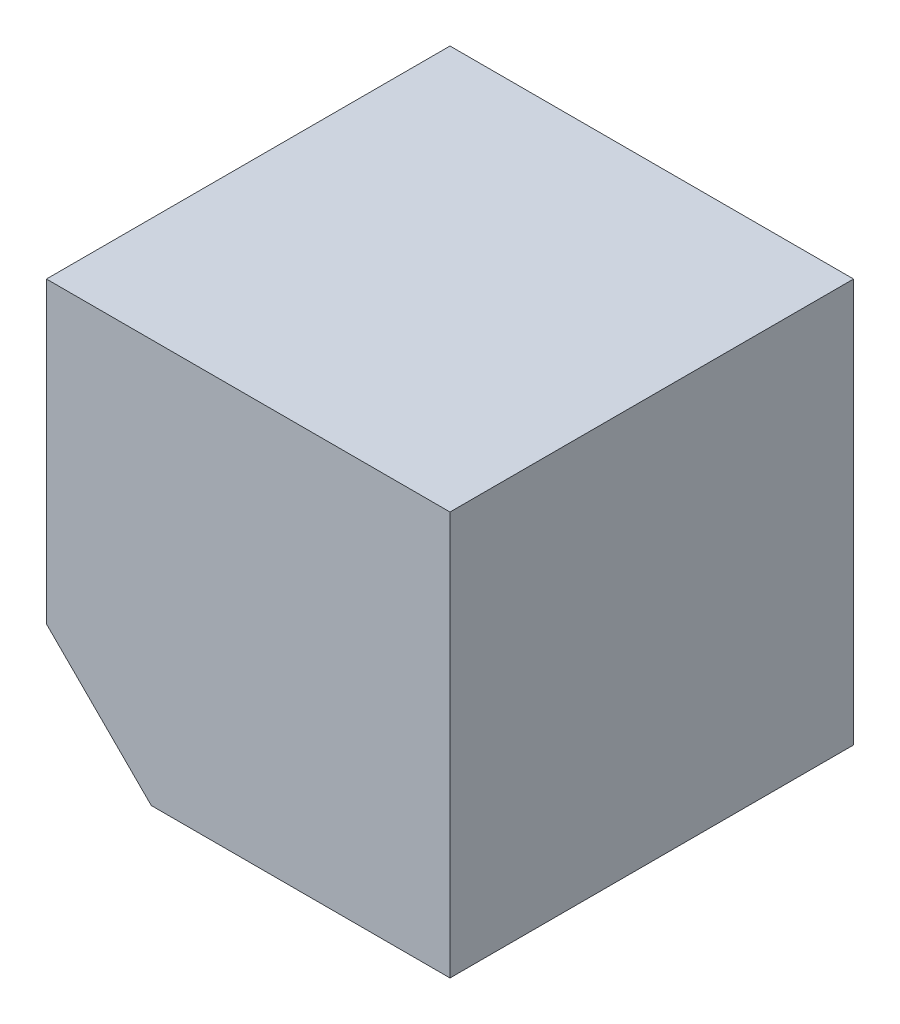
from build123d import *

# Parameters (mm, degrees)
SKIZZE1_W               = 100
SKIZZE1_H               = 100
LINEAR_AUSTRAGEN1_DEPTH = 100


with BuildPart() as part:
    # Skizze1 → Linear austragen1 (new body)
    with BuildSketch(Plane.XY):
        with Locations((50, 50)):
            Rectangle(SKIZZE1_W, SKIZZE1_H)
    extrude(amount=LINEAR_AUSTRAGEN1_DEPTH)

    # Oberfl_chenschnitt1
    split(bisect_by=Plane(origin=(-24.673079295, -24.673079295, 24.673079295), x_dir=(-0.816496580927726, 0.408248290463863, -0.4082482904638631), z_dir=(0.5773502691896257, 0.5773502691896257, -0.5773502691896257)), keep=Keep.TOP)


solid = part.part
